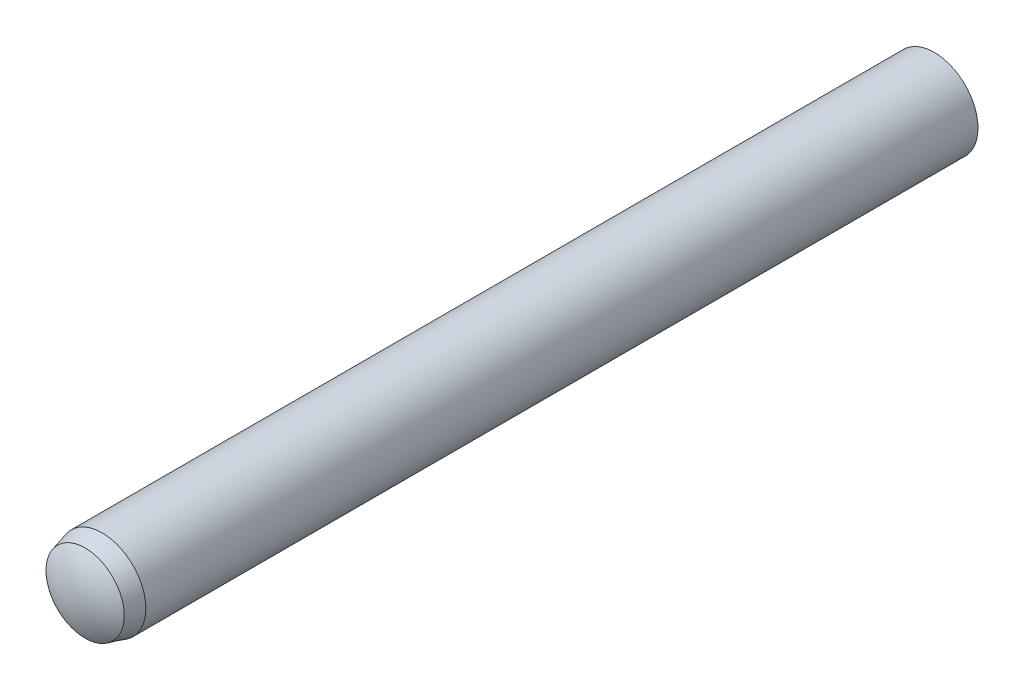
ISO-10303-21;
HEADER;
FILE_DESCRIPTION(('STEP AP214'),'2;1');
FILE_NAME('part.step','',(''),(''),'','','');
FILE_SCHEMA(('AUTOMOTIVE_DESIGN { 1 0 10303 214 1 1 1 1 }'));
ENDSEC;
DATA;
#1=APPLICATION_CONTEXT('core data for automotive mechanical design processes');
#2=APPLICATION_PROTOCOL_DEFINITION('international standard','automotive_design',2000,#1);
#3=PRODUCT_CONTEXT('',#1,'mechanical');
#4=PRODUCT('Part','Part','',(#3));
#5=PRODUCT_RELATED_PRODUCT_CATEGORY('part','',(#4));
#6=PRODUCT_DEFINITION_FORMATION('','',#4);
#7=PRODUCT_DEFINITION_CONTEXT('part definition',#1,'design');
#8=PRODUCT_DEFINITION('design','',#6,#7);
#9=PRODUCT_DEFINITION_SHAPE('','',#8);
#10=(LENGTH_UNIT() NAMED_UNIT(*) SI_UNIT(.MILLI.,.METRE.));
#11=(NAMED_UNIT(*) PLANE_ANGLE_UNIT() SI_UNIT($,.RADIAN.));
#12=(NAMED_UNIT(*) SI_UNIT($,.STERADIAN.) SOLID_ANGLE_UNIT());
#13=UNCERTAINTY_MEASURE_WITH_UNIT(LENGTH_MEASURE(1.E-05),#10,'distance_accuracy_value','');
#14=(GEOMETRIC_REPRESENTATION_CONTEXT(3) GLOBAL_UNCERTAINTY_ASSIGNED_CONTEXT((#13)) GLOBAL_UNIT_ASSIGNED_CONTEXT((#10,
#11,#12)) REPRESENTATION_CONTEXT('',''));
#15=CARTESIAN_POINT('',(0.,0.,0.));
#16=DIRECTION('',(0.,0.,1.));
#17=DIRECTION('',(1.,0.,0.));
#18=AXIS2_PLACEMENT_3D('',#15,#16,#17);
#19=CARTESIAN_POINT('',(0.,0.,-16.3666666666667));
#20=DIRECTION('',(0.,0.,1.));
#21=DIRECTION('',(0.,1.,0.));
#22=AXIS2_PLACEMENT_3D('',#19,#20,#21);
#23=SPHERICAL_SURFACE('',#22,3.63333333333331);
#24=CARTESIAN_POINT('',(0.,0.,-19.4));
#25=DIRECTION('',(0.,0.,1.));
#26=DIRECTION('',(0.,-1.,0.));
#27=AXIS2_PLACEMENT_3D('',#24,#25,#26);
#28=CIRCLE('',#27,1.99999999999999);
#29=CARTESIAN_POINT('',(0.,-1.99999999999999,-19.4));
#30=VERTEX_POINT('',#29);
#31=EDGE_CURVE('E10',#30,#30,#28,.T.);
#32=ORIENTED_EDGE('',*,*,#31,.F.);
#33=EDGE_LOOP('',(#32));
#34=FACE_BOUND('',#33,.T.);
#35=ADVANCED_FACE('F34',(#34),#23,.T.);
#36=CARTESIAN_POINT('',(0.,0.,20.));
#37=DIRECTION('',(0.,0.,1.));
#38=DIRECTION('',(0.,-1.,0.));
#39=AXIS2_PLACEMENT_3D('',#36,#37,#38);
#40=CYLINDRICAL_SURFACE('',#39,2.);
#41=CARTESIAN_POINT('',(0.,0.,18.7));
#42=DIRECTION('',(0.,0.,1.));
#43=DIRECTION('',(0.,-1.,0.));
#44=AXIS2_PLACEMENT_3D('',#41,#42,#43);
#45=CIRCLE('',#44,2.);
#46=CARTESIAN_POINT('',(0.,-2.,18.7));
#47=VERTEX_POINT('',#46);
#48=EDGE_CURVE('E40',#47,#47,#45,.T.);
#49=ORIENTED_EDGE('',*,*,#48,.F.);
#50=EDGE_LOOP('',(#49));
#51=FACE_BOUND('',#50,.T.);
#52=ORIENTED_EDGE('',*,*,#31,.T.);
#53=EDGE_LOOP('',(#52));
#54=FACE_BOUND('',#53,.T.);
#55=ADVANCED_FACE('F55',(#51,#54),#40,.T.);
#56=CARTESIAN_POINT('',(0.,0.,18.7));
#57=DIRECTION('',(0.,0.,-1.));
#58=DIRECTION('',(0.,1.,0.));
#59=AXIS2_PLACEMENT_3D('',#56,#57,#58);
#60=CONICAL_SURFACE('',#59,2.,0.261799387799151);
#61=CARTESIAN_POINT('',(0.,0.,19.48));
#62=DIRECTION('',(0.,0.,1.));
#63=DIRECTION('',(0.,-1.,0.));
#64=AXIS2_PLACEMENT_3D('',#61,#62,#63);
#65=CIRCLE('',#64,1.79099962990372);
#66=CARTESIAN_POINT('',(0.,-1.79099962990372,19.48));
#67=VERTEX_POINT('',#66);
#68=EDGE_CURVE('E44',#67,#67,#65,.T.);
#69=ORIENTED_EDGE('',*,*,#68,.F.);
#70=EDGE_LOOP('',(#69));
#71=FACE_BOUND('',#70,.T.);
#72=ORIENTED_EDGE('',*,*,#48,.T.);
#73=EDGE_LOOP('',(#72));
#74=FACE_BOUND('',#73,.T.);
#75=ADVANCED_FACE('F53',(#71,#74),#60,.T.);
#76=CARTESIAN_POINT('',(0.,0.,16.6556926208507));
#77=DIRECTION('',(0.,0.,1.));
#78=DIRECTION('',(0.,1.,0.));
#79=AXIS2_PLACEMENT_3D('',#76,#77,#78);
#80=SPHERICAL_SURFACE('',#79,3.34430737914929);
#81=ORIENTED_EDGE('',*,*,#68,.T.);
#82=EDGE_LOOP('',(#81));
#83=FACE_BOUND('',#82,.T.);
#84=ADVANCED_FACE('F51',(#83),#80,.T.);
#85=CLOSED_SHELL('',(#35,#55,#75,#84));
#86=MANIFOLD_SOLID_BREP('B2',#85);
#87=ADVANCED_BREP_SHAPE_REPRESENTATION('',(#18,#86),#14);
#88=SHAPE_DEFINITION_REPRESENTATION(#9,#87);
ENDSEC;
END-ISO-10303-21;
